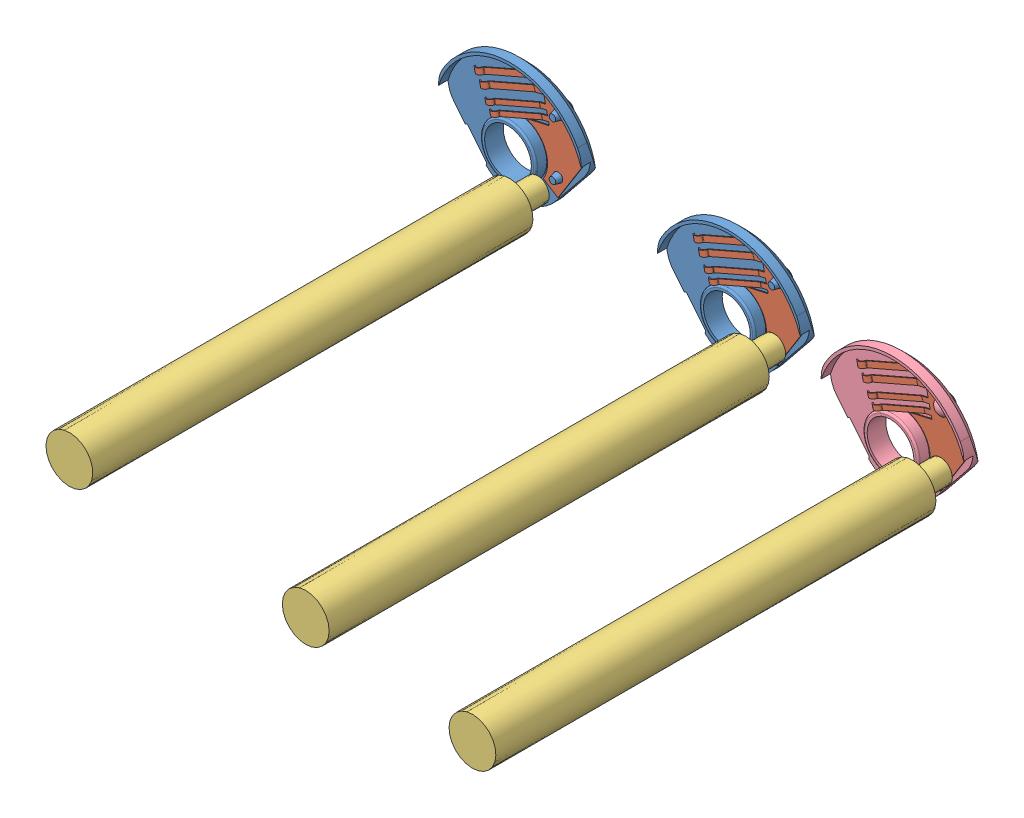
SolidWorks assembly support_curseur_equipe sertissage.SLDASM, configuration Défaut (file format 5000). Lengths in mm.
Overall size (57.51 21.87 54.49).
9 component instances, 4 part files, 0 mates.
Components (placement in the parent):
- support curseur moulage-1: support curseur moulage.sldprt [Défaut] at origin size (15.22 13.25 3.4)
- curseur-1: curseur.sldprt [Défaut] at (-1.1141 -0.2483 3.2519) x (-0.901769 -0.423764 0.085069) z (-0.085069 -0.018956 -0.996195) size (8.28 11.6 1.57)
- bouterole-1: bouterole.sldprt [Défaut] at (4.25 -0.7 52.2861) x (0 0 -1) z (0.211101 -0.977464 0) size (50 5 5)
- support curseur moulage-2: support curseur moulage.sldprt [Défaut] at (23.378 -3.8505 0) size (15.22 13.25 3.4)
- support curseur-1: support curseur.sldprt [Défaut] at (40.8544 -6.729 0) size (15.22 13.25 3.4)
- curseur-2: curseur.sldprt [Défaut] at (22.264 -4.0988 3.2519) x (-0.901769 -0.423764 0.085069) z (-0.085069 -0.018956 -0.996195) size (8.28 11.6 1.57)
- curseur-3: curseur.sldprt [Défaut] at (39.7403 -6.9772 3.2519) x (-0.901769 -0.423764 0.085069) z (-0.085069 -0.018956 -0.996195) size (8.28 11.6 1.57)
- bouterole-2: bouterole.sldprt [Défaut] at (27.628 -4.5504 50.4248) x (0 0 -1) z (0.864803 0.502112 0) size (50 5 5)
- bouterole-3: bouterole.sldprt [Défaut] at (45.1044 -7.429 50.1) x (0 0 -1) z (0.973322 0.229444 0) size (50 5 5)
